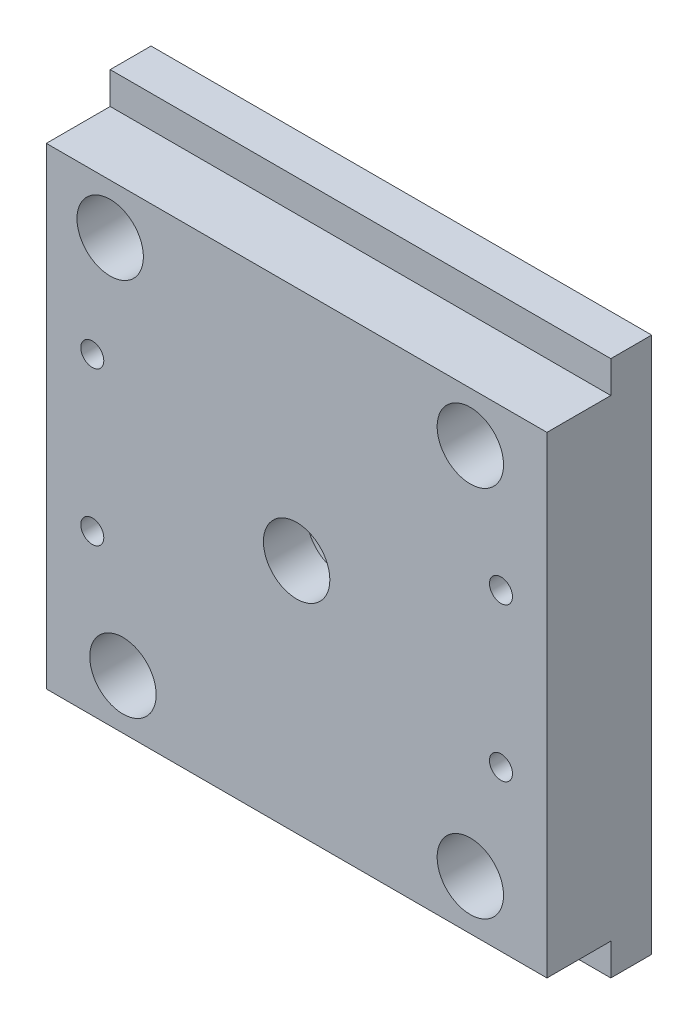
ISO-10303-21;
HEADER;
FILE_DESCRIPTION(('STEP AP214'),'2;1');
FILE_NAME('part.step','',(''),(''),'','','');
FILE_SCHEMA(('AUTOMOTIVE_DESIGN { 1 0 10303 214 1 1 1 1 }'));
ENDSEC;
DATA;
#1=APPLICATION_CONTEXT('core data for automotive mechanical design processes');
#2=APPLICATION_PROTOCOL_DEFINITION('international standard','automotive_design',2000,#1);
#3=PRODUCT_CONTEXT('',#1,'mechanical');
#4=PRODUCT('Part','Part','',(#3));
#5=PRODUCT_RELATED_PRODUCT_CATEGORY('part','',(#4));
#6=PRODUCT_DEFINITION_FORMATION('','',#4);
#7=PRODUCT_DEFINITION_CONTEXT('part definition',#1,'design');
#8=PRODUCT_DEFINITION('design','',#6,#7);
#9=PRODUCT_DEFINITION_SHAPE('','',#8);
#10=(LENGTH_UNIT() NAMED_UNIT(*) SI_UNIT(.MILLI.,.METRE.));
#11=(NAMED_UNIT(*) PLANE_ANGLE_UNIT() SI_UNIT($,.RADIAN.));
#12=(NAMED_UNIT(*) SI_UNIT($,.STERADIAN.) SOLID_ANGLE_UNIT());
#13=UNCERTAINTY_MEASURE_WITH_UNIT(LENGTH_MEASURE(1.E-05),#10,'distance_accuracy_value','');
#14=(GEOMETRIC_REPRESENTATION_CONTEXT(3) GLOBAL_UNCERTAINTY_ASSIGNED_CONTEXT((#13)) GLOBAL_UNIT_ASSIGNED_CONTEXT((#10,
#11,#12)) REPRESENTATION_CONTEXT('',''));
#15=CARTESIAN_POINT('',(0.,0.,0.));
#16=DIRECTION('',(0.,0.,1.));
#17=DIRECTION('',(1.,0.,0.));
#18=AXIS2_PLACEMENT_3D('',#15,#16,#17);
#19=CARTESIAN_POINT('',(25.,178.,41.000025));
#20=DIRECTION('',(0.,0.,-1.));
#21=DIRECTION('',(-1.,0.,0.));
#22=AXIS2_PLACEMENT_3D('',#19,#20,#21);
#23=CYLINDRICAL_SURFACE('',#22,13.);
#24=CARTESIAN_POINT('',(25.,178.,41.));
#25=DIRECTION('',(0.,0.,1.));
#26=DIRECTION('',(1.,0.,0.));
#27=AXIS2_PLACEMENT_3D('',#24,#25,#26);
#28=CIRCLE('',#27,13.);
#29=CARTESIAN_POINT('',(38.,178.,41.));
#30=VERTEX_POINT('',#29);
#31=EDGE_CURVE('E281',#30,#30,#28,.T.);
#32=ORIENTED_EDGE('',*,*,#31,.T.);
#33=EDGE_LOOP('',(#32));
#34=FACE_BOUND('',#33,.T.);
#35=CARTESIAN_POINT('',(25.,178.,6.3));
#36=DIRECTION('',(0.,0.,-1.));
#37=DIRECTION('',(-1.,0.,0.));
#38=AXIS2_PLACEMENT_3D('',#35,#36,#37);
#39=CIRCLE('',#38,13.);
#40=CARTESIAN_POINT('',(12.,178.,6.3));
#41=VERTEX_POINT('',#40);
#42=EDGE_CURVE('E210',#41,#41,#39,.F.);
#43=ORIENTED_EDGE('',*,*,#42,.F.);
#44=EDGE_LOOP('',(#43));
#45=FACE_BOUND('',#44,.T.);
#46=ADVANCED_FACE('F47',(#34,#45),#23,.F.);
#47=CARTESIAN_POINT('',(166.,178.,41.000025));
#48=DIRECTION('',(0.,0.,-1.));
#49=DIRECTION('',(-1.,0.,0.));
#50=AXIS2_PLACEMENT_3D('',#47,#48,#49);
#51=CYLINDRICAL_SURFACE('',#50,13.);
#52=CARTESIAN_POINT('',(166.,178.,41.));
#53=DIRECTION('',(0.,0.,1.));
#54=DIRECTION('',(1.,0.,0.));
#55=AXIS2_PLACEMENT_3D('',#52,#53,#54);
#56=CIRCLE('',#55,13.);
#57=CARTESIAN_POINT('',(179.,178.,41.));
#58=VERTEX_POINT('',#57);
#59=EDGE_CURVE('E312',#58,#58,#56,.T.);
#60=ORIENTED_EDGE('',*,*,#59,.T.);
#61=EDGE_LOOP('',(#60));
#62=FACE_BOUND('',#61,.T.);
#63=CARTESIAN_POINT('',(166.,178.,6.3));
#64=DIRECTION('',(0.,0.,-1.));
#65=DIRECTION('',(-1.,0.,0.));
#66=AXIS2_PLACEMENT_3D('',#63,#64,#65);
#67=CIRCLE('',#66,13.);
#68=CARTESIAN_POINT('',(153.,178.,6.3));
#69=VERTEX_POINT('',#68);
#70=EDGE_CURVE('E217',#69,#69,#67,.F.);
#71=ORIENTED_EDGE('',*,*,#70,.F.);
#72=EDGE_LOOP('',(#71));
#73=FACE_BOUND('',#72,.T.);
#74=ADVANCED_FACE('F508',(#62,#73),#51,.F.);
#75=CARTESIAN_POINT('',(166.,32.,41.000025));
#76=DIRECTION('',(0.,0.,-1.));
#77=DIRECTION('',(-1.,0.,0.));
#78=AXIS2_PLACEMENT_3D('',#75,#76,#77);
#79=CYLINDRICAL_SURFACE('',#78,13.);
#80=CARTESIAN_POINT('',(166.,32.,41.));
#81=DIRECTION('',(0.,0.,1.));
#82=DIRECTION('',(1.,0.,0.));
#83=AXIS2_PLACEMENT_3D('',#80,#81,#82);
#84=CIRCLE('',#83,13.);
#85=CARTESIAN_POINT('',(179.,32.,41.));
#86=VERTEX_POINT('',#85);
#87=EDGE_CURVE('E315',#86,#86,#84,.T.);
#88=ORIENTED_EDGE('',*,*,#87,.T.);
#89=EDGE_LOOP('',(#88));
#90=FACE_BOUND('',#89,.T.);
#91=CARTESIAN_POINT('',(166.,32.,6.3));
#92=DIRECTION('',(0.,0.,-1.));
#93=DIRECTION('',(-1.,0.,0.));
#94=AXIS2_PLACEMENT_3D('',#91,#92,#93);
#95=CIRCLE('',#94,13.);
#96=CARTESIAN_POINT('',(153.,32.,6.3));
#97=VERTEX_POINT('',#96);
#98=EDGE_CURVE('E224',#97,#97,#95,.F.);
#99=ORIENTED_EDGE('',*,*,#98,.F.);
#100=EDGE_LOOP('',(#99));
#101=FACE_BOUND('',#100,.T.);
#102=ADVANCED_FACE('F514',(#90,#101),#79,.F.);
#103=CARTESIAN_POINT('',(30.,32.,41.000025));
#104=DIRECTION('',(0.,0.,-1.));
#105=DIRECTION('',(-1.,0.,0.));
#106=AXIS2_PLACEMENT_3D('',#103,#104,#105);
#107=CYLINDRICAL_SURFACE('',#106,13.);
#108=CARTESIAN_POINT('',(30.,32.,41.));
#109=DIRECTION('',(0.,0.,1.));
#110=DIRECTION('',(1.,0.,0.));
#111=AXIS2_PLACEMENT_3D('',#108,#109,#110);
#112=CIRCLE('',#111,13.);
#113=CARTESIAN_POINT('',(43.,32.,41.));
#114=VERTEX_POINT('',#113);
#115=EDGE_CURVE('E318',#114,#114,#112,.T.);
#116=ORIENTED_EDGE('',*,*,#115,.T.);
#117=EDGE_LOOP('',(#116));
#118=FACE_BOUND('',#117,.T.);
#119=CARTESIAN_POINT('',(30.,32.,6.3));
#120=DIRECTION('',(0.,0.,-1.));
#121=DIRECTION('',(-1.,0.,0.));
#122=AXIS2_PLACEMENT_3D('',#119,#120,#121);
#123=CIRCLE('',#122,13.);
#124=CARTESIAN_POINT('',(17.,32.,6.3));
#125=VERTEX_POINT('',#124);
#126=EDGE_CURVE('E231',#125,#125,#123,.F.);
#127=ORIENTED_EDGE('',*,*,#126,.F.);
#128=EDGE_LOOP('',(#127));
#129=FACE_BOUND('',#128,.T.);
#130=ADVANCED_FACE('F877',(#118,#129),#107,.F.);
#131=CARTESIAN_POINT('',(178.,135.,41.000025));
#132=DIRECTION('',(0.,0.,-1.));
#133=DIRECTION('',(-1.,0.,0.));
#134=AXIS2_PLACEMENT_3D('',#131,#132,#133);
#135=CYLINDRICAL_SURFACE('',#134,4.49999999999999);
#136=CARTESIAN_POINT('',(178.,135.,41.));
#137=DIRECTION('',(0.,0.,1.));
#138=DIRECTION('',(1.,0.,0.));
#139=AXIS2_PLACEMENT_3D('',#136,#137,#138);
#140=CIRCLE('',#139,4.49999999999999);
#141=CARTESIAN_POINT('',(182.5,135.,41.));
#142=VERTEX_POINT('',#141);
#143=EDGE_CURVE('E330',#142,#142,#140,.T.);
#144=ORIENTED_EDGE('',*,*,#143,.T.);
#145=EDGE_LOOP('',(#144));
#146=FACE_BOUND('',#145,.T.);
#147=CARTESIAN_POINT('',(178.,135.,9.00000000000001));
#148=DIRECTION('',(0.,0.,-1.));
#149=DIRECTION('',(-1.,0.,0.));
#150=AXIS2_PLACEMENT_3D('',#147,#148,#149);
#151=CIRCLE('',#150,4.49999999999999);
#152=CARTESIAN_POINT('',(173.5,135.,9.00000000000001));
#153=VERTEX_POINT('',#152);
#154=EDGE_CURVE('E238',#153,#153,#151,.F.);
#155=ORIENTED_EDGE('',*,*,#154,.F.);
#156=EDGE_LOOP('',(#155));
#157=FACE_BOUND('',#156,.T.);
#158=ADVANCED_FACE('F884',(#146,#157),#135,.F.);
#159=CARTESIAN_POINT('',(178.,75.,41.000025));
#160=DIRECTION('',(0.,0.,-1.));
#161=DIRECTION('',(-1.,0.,0.));
#162=AXIS2_PLACEMENT_3D('',#159,#160,#161);
#163=CYLINDRICAL_SURFACE('',#162,4.49999999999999);
#164=CARTESIAN_POINT('',(178.,75.,41.));
#165=DIRECTION('',(0.,0.,1.));
#166=DIRECTION('',(1.,0.,0.));
#167=AXIS2_PLACEMENT_3D('',#164,#165,#166);
#168=CIRCLE('',#167,4.49999999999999);
#169=CARTESIAN_POINT('',(182.5,75.,41.));
#170=VERTEX_POINT('',#169);
#171=EDGE_CURVE('E327',#170,#170,#168,.T.);
#172=ORIENTED_EDGE('',*,*,#171,.T.);
#173=EDGE_LOOP('',(#172));
#174=FACE_BOUND('',#173,.T.);
#175=CARTESIAN_POINT('',(178.,75.,9.00000000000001));
#176=DIRECTION('',(0.,0.,-1.));
#177=DIRECTION('',(-1.,0.,0.));
#178=AXIS2_PLACEMENT_3D('',#175,#176,#177);
#179=CIRCLE('',#178,4.49999999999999);
#180=CARTESIAN_POINT('',(173.5,75.,9.00000000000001));
#181=VERTEX_POINT('',#180);
#182=EDGE_CURVE('E245',#181,#181,#179,.F.);
#183=ORIENTED_EDGE('',*,*,#182,.F.);
#184=EDGE_LOOP('',(#183));
#185=FACE_BOUND('',#184,.T.);
#186=ADVANCED_FACE('F893',(#174,#185),#163,.F.);
#187=CARTESIAN_POINT('',(18.,75.,41.000025));
#188=DIRECTION('',(0.,0.,-1.));
#189=DIRECTION('',(-1.,0.,0.));
#190=AXIS2_PLACEMENT_3D('',#187,#188,#189);
#191=CYLINDRICAL_SURFACE('',#190,4.50000000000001);
#192=CARTESIAN_POINT('',(18.,75.,41.));
#193=DIRECTION('',(0.,0.,1.));
#194=DIRECTION('',(1.,0.,0.));
#195=AXIS2_PLACEMENT_3D('',#192,#193,#194);
#196=CIRCLE('',#195,4.50000000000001);
#197=CARTESIAN_POINT('',(22.5,75.,41.));
#198=VERTEX_POINT('',#197);
#199=EDGE_CURVE('E321',#198,#198,#196,.T.);
#200=ORIENTED_EDGE('',*,*,#199,.T.);
#201=EDGE_LOOP('',(#200));
#202=FACE_BOUND('',#201,.T.);
#203=CARTESIAN_POINT('',(18.,75.,9.00000000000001));
#204=DIRECTION('',(0.,0.,-1.));
#205=DIRECTION('',(-1.,0.,0.));
#206=AXIS2_PLACEMENT_3D('',#203,#204,#205);
#207=CIRCLE('',#206,4.50000000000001);
#208=CARTESIAN_POINT('',(13.5,75.,9.00000000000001));
#209=VERTEX_POINT('',#208);
#210=EDGE_CURVE('E252',#209,#209,#207,.F.);
#211=ORIENTED_EDGE('',*,*,#210,.F.);
#212=EDGE_LOOP('',(#211));
#213=FACE_BOUND('',#212,.T.);
#214=ADVANCED_FACE('F903',(#202,#213),#191,.F.);
#215=CARTESIAN_POINT('',(18.,135.,41.000025));
#216=DIRECTION('',(0.,0.,-1.));
#217=DIRECTION('',(-1.,0.,0.));
#218=AXIS2_PLACEMENT_3D('',#215,#216,#217);
#219=CYLINDRICAL_SURFACE('',#218,4.50000000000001);
#220=CARTESIAN_POINT('',(18.,135.,41.));
#221=DIRECTION('',(0.,0.,1.));
#222=DIRECTION('',(1.,0.,0.));
#223=AXIS2_PLACEMENT_3D('',#220,#221,#222);
#224=CIRCLE('',#223,4.50000000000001);
#225=CARTESIAN_POINT('',(22.5,135.,41.));
#226=VERTEX_POINT('',#225);
#227=EDGE_CURVE('E324',#226,#226,#224,.T.);
#228=ORIENTED_EDGE('',*,*,#227,.T.);
#229=EDGE_LOOP('',(#228));
#230=FACE_BOUND('',#229,.T.);
#231=CARTESIAN_POINT('',(18.,135.,9.00000000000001));
#232=DIRECTION('',(0.,0.,-1.));
#233=DIRECTION('',(-1.,0.,0.));
#234=AXIS2_PLACEMENT_3D('',#231,#232,#233);
#235=CIRCLE('',#234,4.50000000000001);
#236=CARTESIAN_POINT('',(13.5,135.,9.00000000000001));
#237=VERTEX_POINT('',#236);
#238=EDGE_CURVE('E259',#237,#237,#235,.F.);
#239=ORIENTED_EDGE('',*,*,#238,.F.);
#240=EDGE_LOOP('',(#239));
#241=FACE_BOUND('',#240,.T.);
#242=ADVANCED_FACE('F913',(#230,#241),#219,.F.);
#243=CARTESIAN_POINT('',(98.,105.,24.));
#244=DIRECTION('',(0.,0.,-1.));
#245=DIRECTION('',(-1.,0.,0.));
#246=AXIS2_PLACEMENT_3D('',#243,#244,#245);
#247=CYLINDRICAL_SURFACE('',#246,26.);
#248=CARTESIAN_POINT('',(98.,105.,24.));
#249=DIRECTION('',(0.,0.,-1.));
#250=DIRECTION('',(-1.,0.,0.));
#251=AXIS2_PLACEMENT_3D('',#248,#249,#250);
#252=CIRCLE('',#251,26.);
#253=CARTESIAN_POINT('',(72.,105.,24.));
#254=VERTEX_POINT('',#253);
#255=EDGE_CURVE('E267',#254,#254,#252,.T.);
#256=ORIENTED_EDGE('',*,*,#255,.F.);
#257=EDGE_LOOP('',(#256));
#258=FACE_BOUND('',#257,.T.);
#259=CARTESIAN_POINT('',(95.0000000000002,130.82634314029,16.));
#260=CARTESIAN_POINT('',(94.9999915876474,130.826339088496,16.0840813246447));
#261=CARTESIAN_POINT('',(95.0035347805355,130.826753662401,16.1681584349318));
#262=CARTESIAN_POINT('',(95.0176592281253,130.828390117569,16.3357055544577));
#263=CARTESIAN_POINT('',(95.028239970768,130.829611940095,16.41917560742));
#264=CARTESIAN_POINT('',(95.0563598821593,130.832831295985,16.5848368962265));
#265=CARTESIAN_POINT('',(95.0738918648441,130.834828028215,16.6670293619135));
#266=CARTESIAN_POINT('',(95.1157677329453,130.839536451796,16.8296150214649));
#267=CARTESIAN_POINT('',(95.1401115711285,130.842248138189,16.9100082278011));
#268=CARTESIAN_POINT('',(95.22314963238,130.85134914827,17.147697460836));
#269=CARTESIAN_POINT('',(95.291865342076,130.858706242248,17.3015905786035));
#270=CARTESIAN_POINT('',(95.4539466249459,130.875165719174,17.5955645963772));
#271=CARTESIAN_POINT('',(95.5473104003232,130.884267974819,17.7356465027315));
#272=CARTESIAN_POINT('',(95.7565268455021,130.903240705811,17.9987953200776));
#273=CARTESIAN_POINT('',(95.8724711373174,130.91311420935,18.1217892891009));
#274=CARTESIAN_POINT('',(96.1233786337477,130.932491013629,18.3466311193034));
#275=CARTESIAN_POINT('',(96.2583454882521,130.941994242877,18.4484749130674));
#276=CARTESIAN_POINT('',(96.5439370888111,130.959591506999,18.6283945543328));
#277=CARTESIAN_POINT('',(96.6946080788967,130.967681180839,18.7063973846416));
#278=CARTESIAN_POINT('',(97.0069879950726,130.981499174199,18.8359251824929));
#279=CARTESIAN_POINT('',(97.1686899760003,130.987228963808,18.8874666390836));
#280=CARTESIAN_POINT('',(97.4427993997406,130.994259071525,18.9499349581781));
#281=CARTESIAN_POINT('',(97.5534637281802,130.996401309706,18.968694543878));
#282=CARTESIAN_POINT('',(97.7760691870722,130.999276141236,18.9937272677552));
#283=CARTESIAN_POINT('',(97.8880084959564,131.000010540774,19.0000164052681));
#284=CARTESIAN_POINT('',(98.0000000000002,131.,19.));
#285=B_SPLINE_CURVE_WITH_KNOTS('',3,(#259,#260,#261,#262,#263,#264,#265,#266,#267,#268,#269,
#270,#271,#272,#273,#274,#275,#276,#277,#278,#279,#280,#281,#282,#283,#284),.UNSPECIFIED.,.F.,
.F.,(4,2,2,2,2,2,2,2,2,2,2,2,4),(0.,0.25216081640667,0.504303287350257,0.756185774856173,
1.00806651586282,1.5115650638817,2.01502689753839,2.52057580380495,3.02622184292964,
3.5334013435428,4.04026441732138,4.37639073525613,4.71208553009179),.UNSPECIFIED.);
#286=CARTESIAN_POINT('',(95.0000000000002,130.82634314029,16.));
#287=VERTEX_POINT('',#286);
#288=CARTESIAN_POINT('',(98.0000000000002,131.,19.));
#289=VERTEX_POINT('',#288);
#290=EDGE_CURVE('E68',#287,#289,#285,.T.);
#291=ORIENTED_EDGE('',*,*,#290,.T.);
#292=CARTESIAN_POINT('',(98.0000000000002,131.,19.));
#293=CARTESIAN_POINT('',(98.0840832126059,131.000003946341,19.0000084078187));
#294=CARTESIAN_POINT('',(98.1681622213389,130.999592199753,18.9964650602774));
#295=CARTESIAN_POINT('',(98.3357132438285,130.997966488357,18.9823399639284));
#296=CARTESIAN_POINT('',(98.4191853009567,130.996752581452,18.9717587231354));
#297=CARTESIAN_POINT('',(98.584850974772,130.993553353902,18.9436373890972));
#298=CARTESIAN_POINT('',(98.6670458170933,130.991568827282,18.9261044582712));
#299=CARTESIAN_POINT('',(98.829636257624,130.98688769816,18.8842262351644));
#300=CARTESIAN_POINT('',(98.9100318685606,130.984191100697,18.859880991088));
#301=CARTESIAN_POINT('',(99.1477286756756,130.975137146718,18.7768378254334));
#302=CARTESIAN_POINT('',(99.301626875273,130.967813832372,18.7081176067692));
#303=CARTESIAN_POINT('',(99.5956092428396,130.951412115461,18.5460257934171));
#304=CARTESIAN_POINT('',(99.7356944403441,130.942333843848,18.4526560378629));
#305=CARTESIAN_POINT('',(99.9988393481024,130.923389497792,18.2434335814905));
#306=CARTESIAN_POINT('',(100.121827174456,130.913520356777,18.127490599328));
#307=CARTESIAN_POINT('',(100.346657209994,130.894130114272,17.8765882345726));
#308=CARTESIAN_POINT('',(100.448495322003,130.884609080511,17.7416251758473));
#309=CARTESIAN_POINT('',(100.62840903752,130.866961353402,17.456036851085));
#310=CARTESIAN_POINT('',(100.706410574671,130.858839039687,17.3053646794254));
#311=CARTESIAN_POINT('',(100.835935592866,130.844955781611,16.9929823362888));
#312=CARTESIAN_POINT('',(100.887475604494,130.839193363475,16.8312791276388));
#313=CARTESIAN_POINT('',(100.949939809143,130.832121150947,16.5571737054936));
#314=CARTESIAN_POINT('',(100.968697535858,130.829965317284,16.4465149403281));
#315=CARTESIAN_POINT('',(100.993727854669,130.827071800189,16.2239203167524));
#316=CARTESIAN_POINT('',(101.00001641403,130.826332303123,16.1119862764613));
#317=CARTESIAN_POINT('',(101.,130.82634314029,16.));
#318=B_SPLINE_CURVE_WITH_KNOTS('',3,(#292,#293,#294,#295,#296,#297,#298,#299,#300,#301,#302,
#303,#304,#305,#306,#307,#308,#309,#310,#311,#312,#313,#314,#315,#316,#317),.UNSPECIFIED.,.F.,
.F.,(4,2,2,2,2,2,2,2,2,2,2,2,4),(0.,0.252166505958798,0.504314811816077,0.756203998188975,
1.00809140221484,1.51160462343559,2.01508028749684,2.52061257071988,3.02624269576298,
3.53342833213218,4.04029674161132,4.37640645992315,4.71208549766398),.UNSPECIFIED.);
#319=CARTESIAN_POINT('',(101.,130.82634314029,16.));
#320=VERTEX_POINT('',#319);
#321=EDGE_CURVE('E177',#289,#320,#318,.T.);
#322=ORIENTED_EDGE('',*,*,#321,.T.);
#323=DIRECTION('',(0.,0.,-1.));
#324=VECTOR('',#323,1.);
#325=CARTESIAN_POINT('',(101.,130.82634314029,24.));
#326=LINE('',#325,#324);
#327=CARTESIAN_POINT('',(101.,130.82634314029,4.));
#328=VERTEX_POINT('',#327);
#329=EDGE_CURVE('E194',#320,#328,#326,.T.);
#330=ORIENTED_EDGE('',*,*,#329,.T.);
#331=CARTESIAN_POINT('',(98.,105.,4.));
#332=DIRECTION('',(0.,0.,-1.));
#333=DIRECTION('',(-1.,0.,0.));
#334=AXIS2_PLACEMENT_3D('',#331,#332,#333);
#335=CIRCLE('',#334,26.);
#336=CARTESIAN_POINT('',(95.0000000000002,130.82634314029,4.));
#337=VERTEX_POINT('',#336);
#338=EDGE_CURVE('E266',#337,#328,#335,.F.);
#339=ORIENTED_EDGE('',*,*,#338,.F.);
#340=DIRECTION('',(0.,0.,-1.));
#341=VECTOR('',#340,1.);
#342=CARTESIAN_POINT('',(95.0000000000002,130.82634314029,24.));
#343=LINE('',#342,#341);
#344=EDGE_CURVE('E192',#337,#287,#343,.F.);
#345=ORIENTED_EDGE('',*,*,#344,.T.);
#346=EDGE_LOOP('',(#291,#322,#330,#339,#345));
#347=FACE_BOUND('',#346,.T.);
#348=ADVANCED_FACE('F381',(#258,#347),#247,.F.);
#349=CARTESIAN_POINT('',(98.,105.,41.000025));
#350=DIRECTION('',(0.,0.,-1.));
#351=DIRECTION('',(-1.,0.,0.));
#352=AXIS2_PLACEMENT_3D('',#349,#350,#351);
#353=CYLINDRICAL_SURFACE('',#352,13.);
#354=CARTESIAN_POINT('',(98.,105.,41.));
#355=DIRECTION('',(0.,0.,1.));
#356=DIRECTION('',(1.,0.,0.));
#357=AXIS2_PLACEMENT_3D('',#354,#355,#356);
#358=CIRCLE('',#357,13.);
#359=CARTESIAN_POINT('',(111.,105.,41.));
#360=VERTEX_POINT('',#359);
#361=EDGE_CURVE('E333',#360,#360,#358,.T.);
#362=ORIENTED_EDGE('',*,*,#361,.T.);
#363=EDGE_LOOP('',(#362));
#364=FACE_BOUND('',#363,.T.);
#365=CARTESIAN_POINT('',(98.,105.,24.));
#366=DIRECTION('',(0.,0.,-1.));
#367=DIRECTION('',(-1.,0.,0.));
#368=AXIS2_PLACEMENT_3D('',#365,#366,#367);
#369=CIRCLE('',#368,13.);
#370=CARTESIAN_POINT('',(85.,105.,24.));
#371=VERTEX_POINT('',#370);
#372=EDGE_CURVE('E270',#371,#371,#369,.F.);
#373=ORIENTED_EDGE('',*,*,#372,.F.);
#374=EDGE_LOOP('',(#373));
#375=FACE_BOUND('',#374,.T.);
#376=ADVANCED_FACE('F536',(#364,#375),#353,.F.);
#377=CARTESIAN_POINT('',(0.,0.,16.));
#378=DIRECTION('',(0.,0.,-1.));
#379=DIRECTION('',(-1.,0.,0.));
#380=AXIS2_PLACEMENT_3D('',#377,#378,#379);
#381=PLANE('',#380);
#382=DIRECTION('',(-1.,0.,0.));
#383=VECTOR('',#382,1.);
#384=CARTESIAN_POINT('',(0.,197.5,16.));
#385=LINE('',#384,#383);
#386=CARTESIAN_POINT('',(196.,197.5,16.));
#387=VERTEX_POINT('',#386);
#388=CARTESIAN_POINT('',(0.,197.5,16.));
#389=VERTEX_POINT('',#388);
#390=EDGE_CURVE('E280',#387,#389,#385,.T.);
#391=ORIENTED_EDGE('',*,*,#390,.F.);
#392=DIRECTION('',(0.,1.,0.));
#393=VECTOR('',#392,1.);
#394=CARTESIAN_POINT('',(196.,0.,16.));
#395=LINE('',#394,#393);
#396=CARTESIAN_POINT('',(196.,210.,16.));
#397=VERTEX_POINT('',#396);
#398=EDGE_CURVE('E282',#387,#397,#395,.T.);
#399=ORIENTED_EDGE('',*,*,#398,.T.);
#400=DIRECTION('',(-1.,0.,0.));
#401=VECTOR('',#400,1.);
#402=CARTESIAN_POINT('',(0.,210.,16.));
#403=LINE('',#402,#401);
#404=CARTESIAN_POINT('',(0.,210.,16.));
#405=VERTEX_POINT('',#404);
#406=EDGE_CURVE('E590',#397,#405,#403,.T.);
#407=ORIENTED_EDGE('',*,*,#406,.T.);
#408=DIRECTION('',(0.,-1.,0.));
#409=VECTOR('',#408,1.);
#410=CARTESIAN_POINT('',(0.,0.,16.));
#411=LINE('',#410,#409);
#412=EDGE_CURVE('E583',#405,#389,#411,.T.);
#413=ORIENTED_EDGE('',*,*,#412,.T.);
#414=EDGE_LOOP('',(#391,#399,#407,#413));
#415=FACE_BOUND('',#414,.T.);
#416=ADVANCED_FACE('F532',(#415),#381,.F.);
#417=DIRECTION('',(1.,0.,0.));
#418=VECTOR('',#417,1.);
#419=CARTESIAN_POINT('',(0.,12.5,16.));
#420=LINE('',#419,#418);
#421=CARTESIAN_POINT('',(0.,12.5,16.));
#422=VERTEX_POINT('',#421);
#423=CARTESIAN_POINT('',(196.,12.5,16.));
#424=VERTEX_POINT('',#423);
#425=EDGE_CURVE('E276',#422,#424,#420,.T.);
#426=ORIENTED_EDGE('',*,*,#425,.F.);
#427=CARTESIAN_POINT('',(0.,0.,16.));
#428=VERTEX_POINT('',#427);
#429=EDGE_CURVE('E573',#422,#428,#411,.T.);
#430=ORIENTED_EDGE('',*,*,#429,.T.);
#431=DIRECTION('',(1.,0.,0.));
#432=VECTOR('',#431,1.);
#433=CARTESIAN_POINT('',(0.,0.,16.));
#434=LINE('',#433,#432);
#435=CARTESIAN_POINT('',(196.,0.,16.));
#436=VERTEX_POINT('',#435);
#437=EDGE_CURVE('E579',#428,#436,#434,.T.);
#438=ORIENTED_EDGE('',*,*,#437,.T.);
#439=EDGE_CURVE('E567',#436,#424,#395,.T.);
#440=ORIENTED_EDGE('',*,*,#439,.T.);
#441=EDGE_LOOP('',(#426,#430,#438,#440));
#442=FACE_BOUND('',#441,.T.);
#443=ADVANCED_FACE('F535',(#442),#381,.F.);
#444=CARTESIAN_POINT('',(0.,0.,16.));
#445=DIRECTION('',(1.,0.,0.));
#446=DIRECTION('',(0.,0.,-1.));
#447=AXIS2_PLACEMENT_3D('',#444,#445,#446);
#448=PLANE('',#447);
#449=DIRECTION('',(0.,-1.,0.));
#450=VECTOR('',#449,1.);
#451=CARTESIAN_POINT('',(0.,0.,0.));
#452=LINE('',#451,#450);
#453=CARTESIAN_POINT('',(0.,210.,0.));
#454=VERTEX_POINT('',#453);
#455=CARTESIAN_POINT('',(0.,0.,0.));
#456=VERTEX_POINT('',#455);
#457=EDGE_CURVE('E294',#454,#456,#452,.T.);
#458=ORIENTED_EDGE('',*,*,#457,.T.);
#459=DIRECTION('',(0.,0.,-1.));
#460=VECTOR('',#459,1.);
#461=CARTESIAN_POINT('',(0.,0.,16.));
#462=LINE('',#461,#460);
#463=EDGE_CURVE('E364',#428,#456,#462,.T.);
#464=ORIENTED_EDGE('',*,*,#463,.F.);
#465=ORIENTED_EDGE('',*,*,#429,.F.);
#466=DIRECTION('',(0.,0.,-1.));
#467=VECTOR('',#466,1.);
#468=CARTESIAN_POINT('',(0.,12.5,41.));
#469=LINE('',#468,#467);
#470=CARTESIAN_POINT('',(0.,12.5,41.));
#471=VERTEX_POINT('',#470);
#472=EDGE_CURVE('E288',#471,#422,#469,.T.);
#473=ORIENTED_EDGE('',*,*,#472,.F.);
#474=DIRECTION('',(0.,-1.,0.));
#475=VECTOR('',#474,1.);
#476=CARTESIAN_POINT('',(0.,197.5,41.));
#477=LINE('',#476,#475);
#478=CARTESIAN_POINT('',(0.,197.5,41.));
#479=VERTEX_POINT('',#478);
#480=EDGE_CURVE('E299',#479,#471,#477,.T.);
#481=ORIENTED_EDGE('',*,*,#480,.F.);
#482=DIRECTION('',(0.,0.,-1.));
#483=VECTOR('',#482,1.);
#484=CARTESIAN_POINT('',(0.,197.5,41.));
#485=LINE('',#484,#483);
#486=EDGE_CURVE('E300',#479,#389,#485,.T.);
#487=ORIENTED_EDGE('',*,*,#486,.T.);
#488=ORIENTED_EDGE('',*,*,#412,.F.);
#489=DIRECTION('',(0.,0.,-1.));
#490=VECTOR('',#489,1.);
#491=CARTESIAN_POINT('',(0.,210.,16.));
#492=LINE('',#491,#490);
#493=EDGE_CURVE('E587',#405,#454,#492,.T.);
#494=ORIENTED_EDGE('',*,*,#493,.T.);
#495=EDGE_LOOP('',(#458,#464,#465,#473,#481,#487,#488,#494));
#496=FACE_BOUND('',#495,.T.);
#497=ADVANCED_FACE('F49',(#496),#448,.F.);
#498=CARTESIAN_POINT('',(0.,0.,16.));
#499=DIRECTION('',(0.,1.,0.));
#500=DIRECTION('',(0.,0.,1.));
#501=AXIS2_PLACEMENT_3D('',#498,#499,#500);
#502=PLANE('',#501);
#503=DIRECTION('',(1.,0.,0.));
#504=VECTOR('',#503,1.);
#505=CARTESIAN_POINT('',(0.,0.,0.));
#506=LINE('',#505,#504);
#507=CARTESIAN_POINT('',(196.,0.,0.));
#508=VERTEX_POINT('',#507);
#509=EDGE_CURVE('E553',#456,#508,#506,.T.);
#510=ORIENTED_EDGE('',*,*,#509,.T.);
#511=DIRECTION('',(0.,0.,-1.));
#512=VECTOR('',#511,1.);
#513=CARTESIAN_POINT('',(196.,0.,16.));
#514=LINE('',#513,#512);
#515=EDGE_CURVE('E556',#436,#508,#514,.T.);
#516=ORIENTED_EDGE('',*,*,#515,.F.);
#517=ORIENTED_EDGE('',*,*,#437,.F.);
#518=ORIENTED_EDGE('',*,*,#463,.T.);
#519=EDGE_LOOP('',(#510,#516,#517,#518));
#520=FACE_BOUND('',#519,.T.);
#521=ADVANCED_FACE('F543',(#520),#502,.F.);
#522=CARTESIAN_POINT('',(196.,0.,16.));
#523=DIRECTION('',(-1.,0.,0.));
#524=DIRECTION('',(0.,0.,1.));
#525=AXIS2_PLACEMENT_3D('',#522,#523,#524);
#526=PLANE('',#525);
#527=DIRECTION('',(0.,1.,0.));
#528=VECTOR('',#527,1.);
#529=CARTESIAN_POINT('',(196.,0.,0.));
#530=LINE('',#529,#528);
#531=CARTESIAN_POINT('',(196.,210.,0.));
#532=VERTEX_POINT('',#531);
#533=EDGE_CURVE('E563',#508,#532,#530,.T.);
#534=ORIENTED_EDGE('',*,*,#533,.T.);
#535=DIRECTION('',(0.,0.,-1.));
#536=VECTOR('',#535,1.);
#537=CARTESIAN_POINT('',(196.,210.,16.));
#538=LINE('',#537,#536);
#539=EDGE_CURVE('E568',#397,#532,#538,.T.);
#540=ORIENTED_EDGE('',*,*,#539,.F.);
#541=ORIENTED_EDGE('',*,*,#398,.F.);
#542=DIRECTION('',(0.,0.,-1.));
#543=VECTOR('',#542,1.);
#544=CARTESIAN_POINT('',(196.,197.5,41.));
#545=LINE('',#544,#543);
#546=CARTESIAN_POINT('',(196.,197.5,41.));
#547=VERTEX_POINT('',#546);
#548=EDGE_CURVE('E289',#547,#387,#545,.T.);
#549=ORIENTED_EDGE('',*,*,#548,.F.);
#550=DIRECTION('',(0.,1.,0.));
#551=VECTOR('',#550,1.);
#552=CARTESIAN_POINT('',(196.,197.5,41.));
#553=LINE('',#552,#551);
#554=CARTESIAN_POINT('',(196.,12.5,41.));
#555=VERTEX_POINT('',#554);
#556=EDGE_CURVE('E601',#555,#547,#553,.T.);
#557=ORIENTED_EDGE('',*,*,#556,.F.);
#558=DIRECTION('',(0.,0.,-1.));
#559=VECTOR('',#558,1.);
#560=CARTESIAN_POINT('',(196.,12.5,41.));
#561=LINE('',#560,#559);
#562=EDGE_CURVE('E285',#555,#424,#561,.T.);
#563=ORIENTED_EDGE('',*,*,#562,.T.);
#564=ORIENTED_EDGE('',*,*,#439,.F.);
#565=ORIENTED_EDGE('',*,*,#515,.T.);
#566=EDGE_LOOP('',(#534,#540,#541,#549,#557,#563,#564,#565));
#567=FACE_BOUND('',#566,.T.);
#568=ADVANCED_FACE('F540',(#567),#526,.F.);
#569=CARTESIAN_POINT('',(0.,210.,16.));
#570=DIRECTION('',(0.,-1.,0.));
#571=DIRECTION('',(1.,0.,0.));
#572=AXIS2_PLACEMENT_3D('',#569,#570,#571);
#573=PLANE('',#572);
#574=DIRECTION('',(-1.,0.,0.));
#575=VECTOR('',#574,1.);
#576=CARTESIAN_POINT('',(0.,210.,0.));
#577=LINE('',#576,#575);
#578=EDGE_CURVE('E571',#532,#454,#577,.T.);
#579=ORIENTED_EDGE('',*,*,#578,.T.);
#580=ORIENTED_EDGE('',*,*,#493,.F.);
#581=ORIENTED_EDGE('',*,*,#406,.F.);
#582=ORIENTED_EDGE('',*,*,#539,.T.);
#583=EDGE_LOOP('',(#579,#580,#581,#582));
#584=FACE_BOUND('',#583,.T.);
#585=ADVANCED_FACE('F530',(#584),#573,.F.);
#586=CARTESIAN_POINT('',(0.,0.,0.));
#587=DIRECTION('',(0.,0.,-1.));
#588=DIRECTION('',(-1.,0.,0.));
#589=AXIS2_PLACEMENT_3D('',#586,#587,#588);
#590=PLANE('',#589);
#591=CARTESIAN_POINT('',(25.,178.,0.));
#592=DIRECTION('',(0.,0.,-1.));
#593=DIRECTION('',(-1.,0.,0.));
#594=AXIS2_PLACEMENT_3D('',#591,#592,#593);
#595=CIRCLE('',#594,16.5);
#596=CARTESIAN_POINT('',(8.49999999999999,178.,0.));
#597=VERTEX_POINT('',#596);
#598=EDGE_CURVE('E204',#597,#597,#595,.T.);
#599=ORIENTED_EDGE('',*,*,#598,.F.);
#600=EDGE_LOOP('',(#599));
#601=FACE_BOUND('',#600,.T.);
#602=CARTESIAN_POINT('',(166.,178.,0.));
#603=DIRECTION('',(0.,0.,-1.));
#604=DIRECTION('',(-1.,0.,0.));
#605=AXIS2_PLACEMENT_3D('',#602,#603,#604);
#606=CIRCLE('',#605,16.5);
#607=CARTESIAN_POINT('',(149.5,178.,0.));
#608=VERTEX_POINT('',#607);
#609=EDGE_CURVE('E211',#608,#608,#606,.T.);
#610=ORIENTED_EDGE('',*,*,#609,.F.);
#611=EDGE_LOOP('',(#610));
#612=FACE_BOUND('',#611,.T.);
#613=CARTESIAN_POINT('',(166.,32.,0.));
#614=DIRECTION('',(0.,0.,-1.));
#615=DIRECTION('',(-1.,0.,0.));
#616=AXIS2_PLACEMENT_3D('',#613,#614,#615);
#617=CIRCLE('',#616,16.5);
#618=CARTESIAN_POINT('',(149.5,32.,0.));
#619=VERTEX_POINT('',#618);
#620=EDGE_CURVE('E218',#619,#619,#617,.T.);
#621=ORIENTED_EDGE('',*,*,#620,.F.);
#622=EDGE_LOOP('',(#621));
#623=FACE_BOUND('',#622,.T.);
#624=CARTESIAN_POINT('',(30.,32.,0.));
#625=DIRECTION('',(0.,0.,-1.));
#626=DIRECTION('',(-1.,0.,0.));
#627=AXIS2_PLACEMENT_3D('',#624,#625,#626);
#628=CIRCLE('',#627,16.5);
#629=CARTESIAN_POINT('',(13.5,32.,0.));
#630=VERTEX_POINT('',#629);
#631=EDGE_CURVE('E225',#630,#630,#628,.T.);
#632=ORIENTED_EDGE('',*,*,#631,.F.);
#633=EDGE_LOOP('',(#632));
#634=FACE_BOUND('',#633,.T.);
#635=CARTESIAN_POINT('',(178.,135.,0.));
#636=DIRECTION('',(0.,0.,-1.));
#637=DIRECTION('',(-1.,0.,0.));
#638=AXIS2_PLACEMENT_3D('',#635,#636,#637);
#639=CIRCLE('',#638,8.00000000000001);
#640=CARTESIAN_POINT('',(170.,135.,0.));
#641=VERTEX_POINT('',#640);
#642=EDGE_CURVE('E232',#641,#641,#639,.T.);
#643=ORIENTED_EDGE('',*,*,#642,.F.);
#644=EDGE_LOOP('',(#643));
#645=FACE_BOUND('',#644,.T.);
#646=CARTESIAN_POINT('',(178.,75.,0.));
#647=DIRECTION('',(0.,0.,-1.));
#648=DIRECTION('',(-1.,0.,0.));
#649=AXIS2_PLACEMENT_3D('',#646,#647,#648);
#650=CIRCLE('',#649,8.00000000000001);
#651=CARTESIAN_POINT('',(170.,75.,0.));
#652=VERTEX_POINT('',#651);
#653=EDGE_CURVE('E239',#652,#652,#650,.T.);
#654=ORIENTED_EDGE('',*,*,#653,.F.);
#655=EDGE_LOOP('',(#654));
#656=FACE_BOUND('',#655,.T.);
#657=CARTESIAN_POINT('',(18.,75.,0.));
#658=DIRECTION('',(0.,0.,-1.));
#659=DIRECTION('',(-1.,0.,0.));
#660=AXIS2_PLACEMENT_3D('',#657,#658,#659);
#661=CIRCLE('',#660,8.);
#662=CARTESIAN_POINT('',(9.99999999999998,75.,0.));
#663=VERTEX_POINT('',#662);
#664=EDGE_CURVE('E246',#663,#663,#661,.T.);
#665=ORIENTED_EDGE('',*,*,#664,.F.);
#666=EDGE_LOOP('',(#665));
#667=FACE_BOUND('',#666,.T.);
#668=CARTESIAN_POINT('',(18.,135.,0.));
#669=DIRECTION('',(0.,0.,-1.));
#670=DIRECTION('',(-1.,0.,0.));
#671=AXIS2_PLACEMENT_3D('',#668,#669,#670);
#672=CIRCLE('',#671,8.);
#673=CARTESIAN_POINT('',(10.,135.,0.));
#674=VERTEX_POINT('',#673);
#675=EDGE_CURVE('E253',#674,#674,#672,.T.);
#676=ORIENTED_EDGE('',*,*,#675,.F.);
#677=EDGE_LOOP('',(#676));
#678=FACE_BOUND('',#677,.T.);
#679=CARTESIAN_POINT('',(98.,105.,0.));
#680=DIRECTION('',(0.,0.,-1.));
#681=DIRECTION('',(-1.,0.,0.));
#682=AXIS2_PLACEMENT_3D('',#679,#680,#681);
#683=CIRCLE('',#682,45.);
#684=CARTESIAN_POINT('',(53.,105.,0.));
#685=VERTEX_POINT('',#684);
#686=EDGE_CURVE('E260',#685,#685,#683,.T.);
#687=ORIENTED_EDGE('',*,*,#686,.F.);
#688=EDGE_LOOP('',(#687));
#689=FACE_BOUND('',#688,.T.);
#690=ORIENTED_EDGE('',*,*,#457,.F.);
#691=ORIENTED_EDGE('',*,*,#578,.F.);
#692=ORIENTED_EDGE('',*,*,#533,.F.);
#693=ORIENTED_EDGE('',*,*,#509,.F.);
#694=EDGE_LOOP('',(#690,#691,#692,#693));
#695=FACE_BOUND('',#694,.T.);
#696=ADVANCED_FACE('F526',(#601,#612,#623,#634,#645,#656,#667,#678,#689,#695),#590,.T.);
#697=CARTESIAN_POINT('',(0.,12.5,41.));
#698=DIRECTION('',(0.,1.,0.));
#699=DIRECTION('',(0.,0.,1.));
#700=AXIS2_PLACEMENT_3D('',#697,#698,#699);
#701=PLANE('',#700);
#702=ORIENTED_EDGE('',*,*,#425,.T.);
#703=ORIENTED_EDGE('',*,*,#562,.F.);
#704=DIRECTION('',(1.,0.,0.));
#705=VECTOR('',#704,1.);
#706=CARTESIAN_POINT('',(0.,12.5,41.));
#707=LINE('',#706,#705);
#708=EDGE_CURVE('E603',#471,#555,#707,.T.);
#709=ORIENTED_EDGE('',*,*,#708,.F.);
#710=ORIENTED_EDGE('',*,*,#472,.T.);
#711=EDGE_LOOP('',(#702,#703,#709,#710));
#712=FACE_BOUND('',#711,.T.);
#713=ADVANCED_FACE('F522',(#712),#701,.F.);
#714=CARTESIAN_POINT('',(0.,197.5,41.));
#715=DIRECTION('',(0.,-1.,0.));
#716=DIRECTION('',(0.,0.,-1.));
#717=AXIS2_PLACEMENT_3D('',#714,#715,#716);
#718=PLANE('',#717);
#719=ORIENTED_EDGE('',*,*,#390,.T.);
#720=ORIENTED_EDGE('',*,*,#486,.F.);
#721=DIRECTION('',(-1.,0.,0.));
#722=VECTOR('',#721,1.);
#723=CARTESIAN_POINT('',(0.,197.5,41.));
#724=LINE('',#723,#722);
#725=EDGE_CURVE('E303',#547,#479,#724,.T.);
#726=ORIENTED_EDGE('',*,*,#725,.F.);
#727=ORIENTED_EDGE('',*,*,#548,.T.);
#728=EDGE_LOOP('',(#719,#720,#726,#727));
#729=FACE_BOUND('',#728,.T.);
#730=ADVANCED_FACE('F503',(#729),#718,.F.);
#731=CARTESIAN_POINT('',(0.,12.5,41.));
#732=DIRECTION('',(0.,0.,1.));
#733=DIRECTION('',(1.,0.,0.));
#734=AXIS2_PLACEMENT_3D('',#731,#732,#733);
#735=PLANE('',#734);
#736=ORIENTED_EDGE('',*,*,#361,.F.);
#737=EDGE_LOOP('',(#736));
#738=FACE_BOUND('',#737,.T.);
#739=ORIENTED_EDGE('',*,*,#143,.F.);
#740=EDGE_LOOP('',(#739));
#741=FACE_BOUND('',#740,.T.);
#742=ORIENTED_EDGE('',*,*,#171,.F.);
#743=EDGE_LOOP('',(#742));
#744=FACE_BOUND('',#743,.T.);
#745=ORIENTED_EDGE('',*,*,#227,.F.);
#746=EDGE_LOOP('',(#745));
#747=FACE_BOUND('',#746,.T.);
#748=ORIENTED_EDGE('',*,*,#199,.F.);
#749=EDGE_LOOP('',(#748));
#750=FACE_BOUND('',#749,.T.);
#751=ORIENTED_EDGE('',*,*,#115,.F.);
#752=EDGE_LOOP('',(#751));
#753=FACE_BOUND('',#752,.T.);
#754=ORIENTED_EDGE('',*,*,#87,.F.);
#755=EDGE_LOOP('',(#754));
#756=FACE_BOUND('',#755,.T.);
#757=ORIENTED_EDGE('',*,*,#59,.F.);
#758=EDGE_LOOP('',(#757));
#759=FACE_BOUND('',#758,.T.);
#760=ORIENTED_EDGE('',*,*,#31,.F.);
#761=EDGE_LOOP('',(#760));
#762=FACE_BOUND('',#761,.T.);
#763=ORIENTED_EDGE('',*,*,#480,.T.);
#764=ORIENTED_EDGE('',*,*,#708,.T.);
#765=ORIENTED_EDGE('',*,*,#556,.T.);
#766=ORIENTED_EDGE('',*,*,#725,.T.);
#767=EDGE_LOOP('',(#763,#764,#765,#766));
#768=FACE_BOUND('',#767,.T.);
#769=ADVANCED_FACE('F498',(#738,#741,#744,#747,#750,#753,#756,#759,#762,#768),#735,.T.);
#770=CARTESIAN_POINT('',(98.,105.,24.));
#771=DIRECTION('',(0.,0.,-1.));
#772=DIRECTION('',(-1.,0.,0.));
#773=AXIS2_PLACEMENT_3D('',#770,#771,#772);
#774=PLANE('',#773);
#775=ORIENTED_EDGE('',*,*,#255,.T.);
#776=EDGE_LOOP('',(#775));
#777=FACE_BOUND('',#776,.T.);
#778=ORIENTED_EDGE('',*,*,#372,.T.);
#779=EDGE_LOOP('',(#778));
#780=FACE_BOUND('',#779,.T.);
#781=ADVANCED_FACE('F494',(#777,#780),#774,.T.);
#782=CARTESIAN_POINT('',(98.,105.,4.));
#783=DIRECTION('',(0.,0.,-1.));
#784=DIRECTION('',(-1.,0.,0.));
#785=AXIS2_PLACEMENT_3D('',#782,#783,#784);
#786=PLANE('',#785);
#787=DIRECTION('',(0.,-1.,0.));
#788=VECTOR('',#787,1.);
#789=CARTESIAN_POINT('',(101.,126.025715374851,4.));
#790=LINE('',#789,#788);
#791=CARTESIAN_POINT('',(101.,142.,4.));
#792=VERTEX_POINT('',#791);
#793=EDGE_CURVE('E189',#792,#328,#790,.T.);
#794=ORIENTED_EDGE('',*,*,#793,.F.);
#795=CARTESIAN_POINT('',(98.0000000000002,142.,4.));
#796=DIRECTION('',(0.,0.,-1.));
#797=DIRECTION('',(-1.,0.,0.));
#798=AXIS2_PLACEMENT_3D('',#795,#796,#797);
#799=CIRCLE('',#798,3.);
#800=CARTESIAN_POINT('',(98.0000000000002,145.,4.));
#801=VERTEX_POINT('',#800);
#802=EDGE_CURVE('E13',#792,#801,#799,.F.);
#803=ORIENTED_EDGE('',*,*,#802,.T.);
#804=CARTESIAN_POINT('',(98.0000000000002,142.,4.));
#805=DIRECTION('',(0.,0.,-1.));
#806=DIRECTION('',(-1.,0.,0.));
#807=AXIS2_PLACEMENT_3D('',#804,#805,#806);
#808=CIRCLE('',#807,3.);
#809=CARTESIAN_POINT('',(95.0000000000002,142.,4.));
#810=VERTEX_POINT('',#809);
#811=EDGE_CURVE('E55',#801,#810,#808,.F.);
#812=ORIENTED_EDGE('',*,*,#811,.T.);
#813=DIRECTION('',(0.,1.,0.));
#814=VECTOR('',#813,1.);
#815=CARTESIAN_POINT('',(95.0000000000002,105.,4.));
#816=LINE('',#815,#814);
#817=EDGE_CURVE('E360',#337,#810,#816,.T.);
#818=ORIENTED_EDGE('',*,*,#817,.F.);
#819=ORIENTED_EDGE('',*,*,#338,.T.);
#820=EDGE_LOOP('',(#794,#803,#812,#818,#819));
#821=FACE_BOUND('',#820,.T.);
#822=CARTESIAN_POINT('',(63.,105.,4.));
#823=DIRECTION('',(0.,0.,-1.));
#824=DIRECTION('',(-1.,0.,0.));
#825=AXIS2_PLACEMENT_3D('',#822,#823,#824);
#826=CIRCLE('',#825,2.49999999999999);
#827=CARTESIAN_POINT('',(60.5,105.,4.));
#828=VERTEX_POINT('',#827);
#829=EDGE_CURVE('E199',#828,#828,#826,.T.);
#830=ORIENTED_EDGE('',*,*,#829,.F.);
#831=EDGE_LOOP('',(#830));
#832=FACE_BOUND('',#831,.T.);
#833=CARTESIAN_POINT('',(133.,105.,4.));
#834=DIRECTION('',(0.,0.,-1.));
#835=DIRECTION('',(-1.,0.,0.));
#836=AXIS2_PLACEMENT_3D('',#833,#834,#835);
#837=CIRCLE('',#836,2.49999999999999);
#838=CARTESIAN_POINT('',(130.5,105.,4.));
#839=VERTEX_POINT('',#838);
#840=EDGE_CURVE('E203',#839,#839,#837,.T.);
#841=ORIENTED_EDGE('',*,*,#840,.F.);
#842=EDGE_LOOP('',(#841));
#843=FACE_BOUND('',#842,.T.);
#844=CARTESIAN_POINT('',(98.,105.,4.));
#845=DIRECTION('',(0.,0.,-1.));
#846=DIRECTION('',(-1.,0.,0.));
#847=AXIS2_PLACEMENT_3D('',#844,#845,#846);
#848=CIRCLE('',#847,45.);
#849=CARTESIAN_POINT('',(53.,105.,4.));
#850=VERTEX_POINT('',#849);
#851=EDGE_CURVE('E263',#850,#850,#848,.T.);
#852=ORIENTED_EDGE('',*,*,#851,.T.);
#853=EDGE_LOOP('',(#852));
#854=FACE_BOUND('',#853,.T.);
#855=ADVANCED_FACE('F491',(#821,#832,#843,#854),#786,.T.);
#856=CARTESIAN_POINT('',(98.,105.,4.));
#857=DIRECTION('',(0.,0.,-1.));
#858=DIRECTION('',(-1.,0.,0.));
#859=AXIS2_PLACEMENT_3D('',#856,#857,#858);
#860=CYLINDRICAL_SURFACE('',#859,45.);
#861=ORIENTED_EDGE('',*,*,#851,.F.);
#862=EDGE_LOOP('',(#861));
#863=FACE_BOUND('',#862,.T.);
#864=ORIENTED_EDGE('',*,*,#686,.T.);
#865=EDGE_LOOP('',(#864));
#866=FACE_BOUND('',#865,.T.);
#867=ADVANCED_FACE('F486',(#863,#866),#860,.F.);
#868=CARTESIAN_POINT('',(18.,135.,9.00000000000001));
#869=DIRECTION('',(0.,0.,-1.));
#870=DIRECTION('',(-1.,0.,0.));
#871=AXIS2_PLACEMENT_3D('',#868,#869,#870);
#872=PLANE('',#871);
#873=CARTESIAN_POINT('',(18.,135.,9.00000000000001));
#874=DIRECTION('',(0.,0.,-1.));
#875=DIRECTION('',(-1.,0.,0.));
#876=AXIS2_PLACEMENT_3D('',#873,#874,#875);
#877=CIRCLE('',#876,8.);
#878=CARTESIAN_POINT('',(10.,135.,9.00000000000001));
#879=VERTEX_POINT('',#878);
#880=EDGE_CURVE('E256',#879,#879,#877,.T.);
#881=ORIENTED_EDGE('',*,*,#880,.T.);
#882=EDGE_LOOP('',(#881));
#883=FACE_BOUND('',#882,.T.);
#884=ORIENTED_EDGE('',*,*,#238,.T.);
#885=EDGE_LOOP('',(#884));
#886=FACE_BOUND('',#885,.T.);
#887=ADVANCED_FACE('F483',(#883,#886),#872,.T.);
#888=CARTESIAN_POINT('',(18.,135.,9.00000000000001));
#889=DIRECTION('',(0.,0.,-1.));
#890=DIRECTION('',(-1.,0.,0.));
#891=AXIS2_PLACEMENT_3D('',#888,#889,#890);
#892=CYLINDRICAL_SURFACE('',#891,8.);
#893=ORIENTED_EDGE('',*,*,#880,.F.);
#894=EDGE_LOOP('',(#893));
#895=FACE_BOUND('',#894,.T.);
#896=ORIENTED_EDGE('',*,*,#675,.T.);
#897=EDGE_LOOP('',(#896));
#898=FACE_BOUND('',#897,.T.);
#899=ADVANCED_FACE('F478',(#895,#898),#892,.F.);
#900=CARTESIAN_POINT('',(18.,75.,9.00000000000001));
#901=DIRECTION('',(0.,0.,-1.));
#902=DIRECTION('',(-1.,0.,0.));
#903=AXIS2_PLACEMENT_3D('',#900,#901,#902);
#904=PLANE('',#903);
#905=CARTESIAN_POINT('',(18.,75.,9.00000000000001));
#906=DIRECTION('',(0.,0.,-1.));
#907=DIRECTION('',(-1.,0.,0.));
#908=AXIS2_PLACEMENT_3D('',#905,#906,#907);
#909=CIRCLE('',#908,8.);
#910=CARTESIAN_POINT('',(9.99999999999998,75.,9.00000000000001));
#911=VERTEX_POINT('',#910);
#912=EDGE_CURVE('E249',#911,#911,#909,.T.);
#913=ORIENTED_EDGE('',*,*,#912,.T.);
#914=EDGE_LOOP('',(#913));
#915=FACE_BOUND('',#914,.T.);
#916=ORIENTED_EDGE('',*,*,#210,.T.);
#917=EDGE_LOOP('',(#916));
#918=FACE_BOUND('',#917,.T.);
#919=ADVANCED_FACE('F475',(#915,#918),#904,.T.);
#920=CARTESIAN_POINT('',(18.,75.,9.00000000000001));
#921=DIRECTION('',(0.,0.,-1.));
#922=DIRECTION('',(-1.,0.,0.));
#923=AXIS2_PLACEMENT_3D('',#920,#921,#922);
#924=CYLINDRICAL_SURFACE('',#923,8.);
#925=ORIENTED_EDGE('',*,*,#912,.F.);
#926=EDGE_LOOP('',(#925));
#927=FACE_BOUND('',#926,.T.);
#928=ORIENTED_EDGE('',*,*,#664,.T.);
#929=EDGE_LOOP('',(#928));
#930=FACE_BOUND('',#929,.T.);
#931=ADVANCED_FACE('F470',(#927,#930),#924,.F.);
#932=CARTESIAN_POINT('',(178.,75.,9.00000000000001));
#933=DIRECTION('',(0.,0.,-1.));
#934=DIRECTION('',(-1.,0.,0.));
#935=AXIS2_PLACEMENT_3D('',#932,#933,#934);
#936=PLANE('',#935);
#937=CARTESIAN_POINT('',(178.,75.,9.00000000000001));
#938=DIRECTION('',(0.,0.,-1.));
#939=DIRECTION('',(-1.,0.,0.));
#940=AXIS2_PLACEMENT_3D('',#937,#938,#939);
#941=CIRCLE('',#940,8.00000000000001);
#942=CARTESIAN_POINT('',(170.,75.,9.00000000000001));
#943=VERTEX_POINT('',#942);
#944=EDGE_CURVE('E242',#943,#943,#941,.T.);
#945=ORIENTED_EDGE('',*,*,#944,.T.);
#946=EDGE_LOOP('',(#945));
#947=FACE_BOUND('',#946,.T.);
#948=ORIENTED_EDGE('',*,*,#182,.T.);
#949=EDGE_LOOP('',(#948));
#950=FACE_BOUND('',#949,.T.);
#951=ADVANCED_FACE('F467',(#947,#950),#936,.T.);
#952=CARTESIAN_POINT('',(178.,75.,9.00000000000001));
#953=DIRECTION('',(0.,0.,-1.));
#954=DIRECTION('',(-1.,0.,0.));
#955=AXIS2_PLACEMENT_3D('',#952,#953,#954);
#956=CYLINDRICAL_SURFACE('',#955,8.00000000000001);
#957=ORIENTED_EDGE('',*,*,#944,.F.);
#958=EDGE_LOOP('',(#957));
#959=FACE_BOUND('',#958,.T.);
#960=ORIENTED_EDGE('',*,*,#653,.T.);
#961=EDGE_LOOP('',(#960));
#962=FACE_BOUND('',#961,.T.);
#963=ADVANCED_FACE('F462',(#959,#962),#956,.F.);
#964=CARTESIAN_POINT('',(178.,135.,9.00000000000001));
#965=DIRECTION('',(0.,0.,-1.));
#966=DIRECTION('',(-1.,0.,0.));
#967=AXIS2_PLACEMENT_3D('',#964,#965,#966);
#968=PLANE('',#967);
#969=CARTESIAN_POINT('',(178.,135.,9.00000000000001));
#970=DIRECTION('',(0.,0.,-1.));
#971=DIRECTION('',(-1.,0.,0.));
#972=AXIS2_PLACEMENT_3D('',#969,#970,#971);
#973=CIRCLE('',#972,8.00000000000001);
#974=CARTESIAN_POINT('',(170.,135.,9.00000000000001));
#975=VERTEX_POINT('',#974);
#976=EDGE_CURVE('E235',#975,#975,#973,.T.);
#977=ORIENTED_EDGE('',*,*,#976,.T.);
#978=EDGE_LOOP('',(#977));
#979=FACE_BOUND('',#978,.T.);
#980=ORIENTED_EDGE('',*,*,#154,.T.);
#981=EDGE_LOOP('',(#980));
#982=FACE_BOUND('',#981,.T.);
#983=ADVANCED_FACE('F459',(#979,#982),#968,.T.);
#984=CARTESIAN_POINT('',(178.,135.,9.00000000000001));
#985=DIRECTION('',(0.,0.,-1.));
#986=DIRECTION('',(-1.,0.,0.));
#987=AXIS2_PLACEMENT_3D('',#984,#985,#986);
#988=CYLINDRICAL_SURFACE('',#987,8.00000000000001);
#989=ORIENTED_EDGE('',*,*,#976,.F.);
#990=EDGE_LOOP('',(#989));
#991=FACE_BOUND('',#990,.T.);
#992=ORIENTED_EDGE('',*,*,#642,.T.);
#993=EDGE_LOOP('',(#992));
#994=FACE_BOUND('',#993,.T.);
#995=ADVANCED_FACE('F454',(#991,#994),#988,.F.);
#996=CARTESIAN_POINT('',(30.,32.,6.3));
#997=DIRECTION('',(0.,0.,-1.));
#998=DIRECTION('',(-1.,0.,0.));
#999=AXIS2_PLACEMENT_3D('',#996,#997,#998);
#1000=PLANE('',#999);
#1001=CARTESIAN_POINT('',(30.,32.,6.3));
#1002=DIRECTION('',(0.,0.,-1.));
#1003=DIRECTION('',(-1.,0.,0.));
#1004=AXIS2_PLACEMENT_3D('',#1001,#1002,#1003);
#1005=CIRCLE('',#1004,16.5);
#1006=CARTESIAN_POINT('',(13.5,32.,6.3));
#1007=VERTEX_POINT('',#1006);
#1008=EDGE_CURVE('E228',#1007,#1007,#1005,.T.);
#1009=ORIENTED_EDGE('',*,*,#1008,.T.);
#1010=EDGE_LOOP('',(#1009));
#1011=FACE_BOUND('',#1010,.T.);
#1012=ORIENTED_EDGE('',*,*,#126,.T.);
#1013=EDGE_LOOP('',(#1012));
#1014=FACE_BOUND('',#1013,.T.);
#1015=ADVANCED_FACE('F451',(#1011,#1014),#1000,.T.);
#1016=CARTESIAN_POINT('',(30.,32.,6.3));
#1017=DIRECTION('',(0.,0.,-1.));
#1018=DIRECTION('',(-1.,0.,0.));
#1019=AXIS2_PLACEMENT_3D('',#1016,#1017,#1018);
#1020=CYLINDRICAL_SURFACE('',#1019,16.5);
#1021=ORIENTED_EDGE('',*,*,#1008,.F.);
#1022=EDGE_LOOP('',(#1021));
#1023=FACE_BOUND('',#1022,.T.);
#1024=ORIENTED_EDGE('',*,*,#631,.T.);
#1025=EDGE_LOOP('',(#1024));
#1026=FACE_BOUND('',#1025,.T.);
#1027=ADVANCED_FACE('F446',(#1023,#1026),#1020,.F.);
#1028=CARTESIAN_POINT('',(166.,32.,6.3));
#1029=DIRECTION('',(0.,0.,-1.));
#1030=DIRECTION('',(-1.,0.,0.));
#1031=AXIS2_PLACEMENT_3D('',#1028,#1029,#1030);
#1032=PLANE('',#1031);
#1033=CARTESIAN_POINT('',(166.,32.,6.3));
#1034=DIRECTION('',(0.,0.,-1.));
#1035=DIRECTION('',(-1.,0.,0.));
#1036=AXIS2_PLACEMENT_3D('',#1033,#1034,#1035);
#1037=CIRCLE('',#1036,16.5);
#1038=CARTESIAN_POINT('',(149.5,32.,6.3));
#1039=VERTEX_POINT('',#1038);
#1040=EDGE_CURVE('E221',#1039,#1039,#1037,.T.);
#1041=ORIENTED_EDGE('',*,*,#1040,.T.);
#1042=EDGE_LOOP('',(#1041));
#1043=FACE_BOUND('',#1042,.T.);
#1044=ORIENTED_EDGE('',*,*,#98,.T.);
#1045=EDGE_LOOP('',(#1044));
#1046=FACE_BOUND('',#1045,.T.);
#1047=ADVANCED_FACE('F443',(#1043,#1046),#1032,.T.);
#1048=CARTESIAN_POINT('',(166.,32.,6.3));
#1049=DIRECTION('',(0.,0.,-1.));
#1050=DIRECTION('',(-1.,0.,0.));
#1051=AXIS2_PLACEMENT_3D('',#1048,#1049,#1050);
#1052=CYLINDRICAL_SURFACE('',#1051,16.5);
#1053=ORIENTED_EDGE('',*,*,#1040,.F.);
#1054=EDGE_LOOP('',(#1053));
#1055=FACE_BOUND('',#1054,.T.);
#1056=ORIENTED_EDGE('',*,*,#620,.T.);
#1057=EDGE_LOOP('',(#1056));
#1058=FACE_BOUND('',#1057,.T.);
#1059=ADVANCED_FACE('F438',(#1055,#1058),#1052,.F.);
#1060=CARTESIAN_POINT('',(166.,178.,6.3));
#1061=DIRECTION('',(0.,0.,-1.));
#1062=DIRECTION('',(-1.,0.,0.));
#1063=AXIS2_PLACEMENT_3D('',#1060,#1061,#1062);
#1064=PLANE('',#1063);
#1065=CARTESIAN_POINT('',(166.,178.,6.3));
#1066=DIRECTION('',(0.,0.,-1.));
#1067=DIRECTION('',(-1.,0.,0.));
#1068=AXIS2_PLACEMENT_3D('',#1065,#1066,#1067);
#1069=CIRCLE('',#1068,16.5);
#1070=CARTESIAN_POINT('',(149.5,178.,6.3));
#1071=VERTEX_POINT('',#1070);
#1072=EDGE_CURVE('E214',#1071,#1071,#1069,.T.);
#1073=ORIENTED_EDGE('',*,*,#1072,.T.);
#1074=EDGE_LOOP('',(#1073));
#1075=FACE_BOUND('',#1074,.T.);
#1076=ORIENTED_EDGE('',*,*,#70,.T.);
#1077=EDGE_LOOP('',(#1076));
#1078=FACE_BOUND('',#1077,.T.);
#1079=ADVANCED_FACE('F435',(#1075,#1078),#1064,.T.);
#1080=CARTESIAN_POINT('',(166.,178.,6.3));
#1081=DIRECTION('',(0.,0.,-1.));
#1082=DIRECTION('',(-1.,0.,0.));
#1083=AXIS2_PLACEMENT_3D('',#1080,#1081,#1082);
#1084=CYLINDRICAL_SURFACE('',#1083,16.5);
#1085=ORIENTED_EDGE('',*,*,#1072,.F.);
#1086=EDGE_LOOP('',(#1085));
#1087=FACE_BOUND('',#1086,.T.);
#1088=ORIENTED_EDGE('',*,*,#609,.T.);
#1089=EDGE_LOOP('',(#1088));
#1090=FACE_BOUND('',#1089,.T.);
#1091=ADVANCED_FACE('F430',(#1087,#1090),#1084,.F.);
#1092=CARTESIAN_POINT('',(25.,178.,6.3));
#1093=DIRECTION('',(0.,0.,-1.));
#1094=DIRECTION('',(-1.,0.,0.));
#1095=AXIS2_PLACEMENT_3D('',#1092,#1093,#1094);
#1096=PLANE('',#1095);
#1097=CARTESIAN_POINT('',(25.,178.,6.3));
#1098=DIRECTION('',(0.,0.,-1.));
#1099=DIRECTION('',(-1.,0.,0.));
#1100=AXIS2_PLACEMENT_3D('',#1097,#1098,#1099);
#1101=CIRCLE('',#1100,16.5);
#1102=CARTESIAN_POINT('',(8.49999999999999,178.,6.3));
#1103=VERTEX_POINT('',#1102);
#1104=EDGE_CURVE('E207',#1103,#1103,#1101,.T.);
#1105=ORIENTED_EDGE('',*,*,#1104,.T.);
#1106=EDGE_LOOP('',(#1105));
#1107=FACE_BOUND('',#1106,.T.);
#1108=ORIENTED_EDGE('',*,*,#42,.T.);
#1109=EDGE_LOOP('',(#1108));
#1110=FACE_BOUND('',#1109,.T.);
#1111=ADVANCED_FACE('F427',(#1107,#1110),#1096,.T.);
#1112=CARTESIAN_POINT('',(25.,178.,6.3));
#1113=DIRECTION('',(0.,0.,-1.));
#1114=DIRECTION('',(-1.,0.,0.));
#1115=AXIS2_PLACEMENT_3D('',#1112,#1113,#1114);
#1116=CYLINDRICAL_SURFACE('',#1115,16.5);
#1117=ORIENTED_EDGE('',*,*,#1104,.F.);
#1118=EDGE_LOOP('',(#1117));
#1119=FACE_BOUND('',#1118,.T.);
#1120=ORIENTED_EDGE('',*,*,#598,.T.);
#1121=EDGE_LOOP('',(#1120));
#1122=FACE_BOUND('',#1121,.T.);
#1123=ADVANCED_FACE('F425',(#1119,#1122),#1116,.F.);
#1124=CARTESIAN_POINT('',(133.,105.,0.));
#1125=DIRECTION('',(0.,0.,-1.));
#1126=DIRECTION('',(-1.,0.,0.));
#1127=AXIS2_PLACEMENT_3D('',#1124,#1125,#1126);
#1128=CYLINDRICAL_SURFACE('',#1127,2.49999999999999);
#1129=ORIENTED_EDGE('',*,*,#840,.T.);
#1130=EDGE_LOOP('',(#1129));
#1131=FACE_BOUND('',#1130,.T.);
#1132=CARTESIAN_POINT('',(133.,105.,17.));
#1133=DIRECTION('',(0.,0.,-1.));
#1134=DIRECTION('',(-1.,0.,0.));
#1135=AXIS2_PLACEMENT_3D('',#1132,#1133,#1134);
#1136=CIRCLE('',#1135,2.49999999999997);
#1137=CARTESIAN_POINT('',(130.5,105.,17.));
#1138=VERTEX_POINT('',#1137);
#1139=EDGE_CURVE('E200',#1138,#1138,#1136,.T.);
#1140=ORIENTED_EDGE('',*,*,#1139,.F.);
#1141=EDGE_LOOP('',(#1140));
#1142=FACE_BOUND('',#1141,.T.);
#1143=ADVANCED_FACE('F421',(#1131,#1142),#1128,.F.);
#1144=CARTESIAN_POINT('',(133.,105.,17.));
#1145=DIRECTION('',(0.,0.,-1.));
#1146=DIRECTION('',(-1.,0.,0.));
#1147=AXIS2_PLACEMENT_3D('',#1144,#1145,#1146);
#1148=CONICAL_SURFACE('',#1147,2.49999999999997,1.02974425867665);
#1149=CARTESIAN_POINT('',(133.,105.,18.5021515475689));
#1150=VERTEX_POINT('',#1149);
#1151=VERTEX_LOOP('',#1150);
#1152=FACE_BOUND('',#1151,.T.);
#1153=ORIENTED_EDGE('',*,*,#1139,.T.);
#1154=EDGE_LOOP('',(#1153));
#1155=FACE_BOUND('',#1154,.T.);
#1156=ADVANCED_FACE('F417',(#1152,#1155),#1148,.F.);
#1157=CARTESIAN_POINT('',(63.,105.,0.));
#1158=DIRECTION('',(0.,0.,-1.));
#1159=DIRECTION('',(-1.,0.,0.));
#1160=AXIS2_PLACEMENT_3D('',#1157,#1158,#1159);
#1161=CYLINDRICAL_SURFACE('',#1160,2.49999999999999);
#1162=ORIENTED_EDGE('',*,*,#829,.T.);
#1163=EDGE_LOOP('',(#1162));
#1164=FACE_BOUND('',#1163,.T.);
#1165=CARTESIAN_POINT('',(63.,105.,17.));
#1166=DIRECTION('',(0.,0.,-1.));
#1167=DIRECTION('',(-1.,0.,0.));
#1168=AXIS2_PLACEMENT_3D('',#1165,#1166,#1167);
#1169=CIRCLE('',#1168,2.49999999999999);
#1170=CARTESIAN_POINT('',(60.5,105.,17.));
#1171=VERTEX_POINT('',#1170);
#1172=EDGE_CURVE('E196',#1171,#1171,#1169,.T.);
#1173=ORIENTED_EDGE('',*,*,#1172,.F.);
#1174=EDGE_LOOP('',(#1173));
#1175=FACE_BOUND('',#1174,.T.);
#1176=ADVANCED_FACE('F413',(#1164,#1175),#1161,.F.);
#1177=CARTESIAN_POINT('',(63.,105.,17.));
#1178=DIRECTION('',(0.,0.,-1.));
#1179=DIRECTION('',(-1.,0.,0.));
#1180=AXIS2_PLACEMENT_3D('',#1177,#1178,#1179);
#1181=CONICAL_SURFACE('',#1180,2.49999999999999,1.02974425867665);
#1182=CARTESIAN_POINT('',(63.,105.,18.5021515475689));
#1183=VERTEX_POINT('',#1182);
#1184=VERTEX_LOOP('',#1183);
#1185=FACE_BOUND('',#1184,.T.);
#1186=ORIENTED_EDGE('',*,*,#1172,.T.);
#1187=EDGE_LOOP('',(#1186));
#1188=FACE_BOUND('',#1187,.T.);
#1189=ADVANCED_FACE('F409',(#1185,#1188),#1181,.F.);
#1190=CARTESIAN_POINT('',(101.,126.025715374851,19.));
#1191=DIRECTION('',(1.,0.,0.));
#1192=DIRECTION('',(0.,0.,-1.));
#1193=AXIS2_PLACEMENT_3D('',#1190,#1191,#1192);
#1194=PLANE('',#1193);
#1195=ORIENTED_EDGE('',*,*,#329,.F.);
#1196=DIRECTION('',(0.,-1.,0.));
#1197=VECTOR('',#1196,1.);
#1198=CARTESIAN_POINT('',(101.,145.,16.));
#1199=LINE('',#1198,#1197);
#1200=CARTESIAN_POINT('',(101.,142.,16.));
#1201=VERTEX_POINT('',#1200);
#1202=EDGE_CURVE('E369',#320,#1201,#1199,.F.);
#1203=ORIENTED_EDGE('',*,*,#1202,.T.);
#1204=DIRECTION('',(0.,0.,-1.));
#1205=VECTOR('',#1204,1.);
#1206=CARTESIAN_POINT('',(101.,142.,4.));
#1207=LINE('',#1206,#1205);
#1208=EDGE_CURVE('E367',#1201,#792,#1207,.T.);
#1209=ORIENTED_EDGE('',*,*,#1208,.T.);
#1210=ORIENTED_EDGE('',*,*,#793,.T.);
#1211=EDGE_LOOP('',(#1195,#1203,#1209,#1210));
#1212=FACE_BOUND('',#1211,.T.);
#1213=ADVANCED_FACE('F405',(#1212),#1194,.F.);
#1214=CARTESIAN_POINT('',(95.0000000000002,126.025715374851,19.));
#1215=DIRECTION('',(-1.,0.,0.));
#1216=DIRECTION('',(0.,0.,1.));
#1217=AXIS2_PLACEMENT_3D('',#1214,#1215,#1216);
#1218=PLANE('',#1217);
#1219=DIRECTION('',(0.,0.,-1.));
#1220=VECTOR('',#1219,1.);
#1221=CARTESIAN_POINT('',(95.0000000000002,142.,19.));
#1222=LINE('',#1221,#1220);
#1223=CARTESIAN_POINT('',(95.0000000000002,142.,16.));
#1224=VERTEX_POINT('',#1223);
#1225=EDGE_CURVE('E363',#810,#1224,#1222,.F.);
#1226=ORIENTED_EDGE('',*,*,#1225,.T.);
#1227=DIRECTION('',(0.,1.,0.));
#1228=VECTOR('',#1227,1.);
#1229=CARTESIAN_POINT('',(95.0000000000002,130.82634314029,16.));
#1230=LINE('',#1229,#1228);
#1231=EDGE_CURVE('E183',#1224,#287,#1230,.F.);
#1232=ORIENTED_EDGE('',*,*,#1231,.T.);
#1233=ORIENTED_EDGE('',*,*,#344,.F.);
#1234=ORIENTED_EDGE('',*,*,#817,.T.);
#1235=EDGE_LOOP('',(#1226,#1232,#1233,#1234));
#1236=FACE_BOUND('',#1235,.T.);
#1237=ADVANCED_FACE('F401',(#1236),#1218,.F.);
#1238=CARTESIAN_POINT('',(98.0000000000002,142.,19.));
#1239=DIRECTION('',(0.,0.,1.));
#1240=DIRECTION('',(1.,0.,0.));
#1241=AXIS2_PLACEMENT_3D('',#1238,#1239,#1240);
#1242=CYLINDRICAL_SURFACE('',#1241,3.);
#1243=CARTESIAN_POINT('',(98.0000000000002,142.,16.));
#1244=DIRECTION('',(0.,0.,-1.));
#1245=DIRECTION('',(-1.,0.,0.));
#1246=AXIS2_PLACEMENT_3D('',#1243,#1244,#1245);
#1247=CIRCLE('',#1246,3.);
#1248=CARTESIAN_POINT('',(98.0000000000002,145.,16.));
#1249=VERTEX_POINT('',#1248);
#1250=EDGE_CURVE('E159',#1249,#1201,#1247,.T.);
#1251=ORIENTED_EDGE('',*,*,#1250,.F.);
#1252=DIRECTION('',(0.,0.,-1.));
#1253=VECTOR('',#1252,1.);
#1254=CARTESIAN_POINT('',(98.0000000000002,145.,19.));
#1255=LINE('',#1254,#1253);
#1256=EDGE_CURVE('E163',#801,#1249,#1255,.F.);
#1257=ORIENTED_EDGE('',*,*,#1256,.F.);
#1258=ORIENTED_EDGE('',*,*,#802,.F.);
#1259=ORIENTED_EDGE('',*,*,#1208,.F.);
#1260=EDGE_LOOP('',(#1251,#1257,#1258,#1259));
#1261=FACE_BOUND('',#1260,.T.);
#1262=ADVANCED_FACE('F398',(#1261),#1242,.F.);
#1263=CARTESIAN_POINT('',(98.0000000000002,142.,16.));
#1264=DIRECTION('',(0.,0.,1.));
#1265=DIRECTION('',(1.,0.,0.));
#1266=AXIS2_PLACEMENT_3D('',#1263,#1264,#1265);
#1267=SPHERICAL_SURFACE('',#1266,3.);
#1268=CARTESIAN_POINT('',(98.0000000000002,142.,16.));
#1269=DIRECTION('',(-1.,0.,0.));
#1270=DIRECTION('',(0.,0.,1.));
#1271=AXIS2_PLACEMENT_3D('',#1268,#1269,#1270);
#1272=CIRCLE('',#1271,3.);
#1273=CARTESIAN_POINT('',(98.0000000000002,142.,19.));
#1274=VERTEX_POINT('',#1273);
#1275=EDGE_CURVE('E157',#1249,#1274,#1272,.F.);
#1276=ORIENTED_EDGE('',*,*,#1275,.F.);
#1277=ORIENTED_EDGE('',*,*,#1250,.T.);
#1278=CARTESIAN_POINT('',(98.0000000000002,142.,16.));
#1279=DIRECTION('',(0.,-1.,0.));
#1280=DIRECTION('',(0.,0.,-1.));
#1281=AXIS2_PLACEMENT_3D('',#1278,#1279,#1280);
#1282=CIRCLE('',#1281,3.);
#1283=EDGE_CURVE('E154',#1274,#1201,#1282,.F.);
#1284=ORIENTED_EDGE('',*,*,#1283,.F.);
#1285=EDGE_LOOP('',(#1276,#1277,#1284));
#1286=FACE_BOUND('',#1285,.T.);
#1287=ADVANCED_FACE('F156',(#1286),#1267,.F.);
#1288=CARTESIAN_POINT('',(98.0000000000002,142.,19.));
#1289=DIRECTION('',(0.,0.,1.));
#1290=DIRECTION('',(1.,0.,0.));
#1291=AXIS2_PLACEMENT_3D('',#1288,#1289,#1290);
#1292=CYLINDRICAL_SURFACE('',#1291,3.);
#1293=ORIENTED_EDGE('',*,*,#811,.F.);
#1294=ORIENTED_EDGE('',*,*,#1256,.T.);
#1295=CARTESIAN_POINT('',(98.0000000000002,142.,16.));
#1296=DIRECTION('',(0.,0.,-1.));
#1297=DIRECTION('',(-1.,0.,0.));
#1298=AXIS2_PLACEMENT_3D('',#1295,#1296,#1297);
#1299=CIRCLE('',#1298,3.);
#1300=EDGE_CURVE('E164',#1224,#1249,#1299,.T.);
#1301=ORIENTED_EDGE('',*,*,#1300,.F.);
#1302=ORIENTED_EDGE('',*,*,#1225,.F.);
#1303=EDGE_LOOP('',(#1293,#1294,#1301,#1302));
#1304=FACE_BOUND('',#1303,.T.);
#1305=ADVANCED_FACE('F392',(#1304),#1292,.F.);
#1306=CARTESIAN_POINT('',(98.0000000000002,145.,16.));
#1307=DIRECTION('',(0.,1.,0.));
#1308=DIRECTION('',(0.,0.,1.));
#1309=AXIS2_PLACEMENT_3D('',#1306,#1307,#1308);
#1310=CYLINDRICAL_SURFACE('',#1309,3.);
#1311=ORIENTED_EDGE('',*,*,#1202,.F.);
#1312=ORIENTED_EDGE('',*,*,#321,.F.);
#1313=DIRECTION('',(0.,-1.,0.));
#1314=VECTOR('',#1313,1.);
#1315=CARTESIAN_POINT('',(98.0000000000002,130.82634314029,19.));
#1316=LINE('',#1315,#1314);
#1317=EDGE_CURVE('E175',#1274,#289,#1316,.T.);
#1318=ORIENTED_EDGE('',*,*,#1317,.F.);
#1319=ORIENTED_EDGE('',*,*,#1283,.T.);
#1320=EDGE_LOOP('',(#1311,#1312,#1318,#1319));
#1321=FACE_BOUND('',#1320,.T.);
#1322=ADVANCED_FACE('F176',(#1321),#1310,.F.);
#1323=CARTESIAN_POINT('',(98.0000000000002,142.,16.));
#1324=DIRECTION('',(0.,0.,1.));
#1325=DIRECTION('',(1.,0.,0.));
#1326=AXIS2_PLACEMENT_3D('',#1323,#1324,#1325);
#1327=SPHERICAL_SURFACE('',#1326,3.);
#1328=ORIENTED_EDGE('',*,*,#1300,.T.);
#1329=ORIENTED_EDGE('',*,*,#1275,.T.);
#1330=CARTESIAN_POINT('',(98.0000000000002,142.,16.));
#1331=DIRECTION('',(0.,-1.,0.));
#1332=DIRECTION('',(0.,0.,-1.));
#1333=AXIS2_PLACEMENT_3D('',#1330,#1331,#1332);
#1334=CIRCLE('',#1333,3.);
#1335=EDGE_CURVE('E171',#1224,#1274,#1334,.F.);
#1336=ORIENTED_EDGE('',*,*,#1335,.F.);
#1337=EDGE_LOOP('',(#1328,#1329,#1336));
#1338=FACE_BOUND('',#1337,.T.);
#1339=ADVANCED_FACE('F169',(#1338),#1327,.F.);
#1340=CARTESIAN_POINT('',(98.0000000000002,145.,16.));
#1341=DIRECTION('',(0.,-1.,0.));
#1342=DIRECTION('',(0.,0.,-1.));
#1343=AXIS2_PLACEMENT_3D('',#1340,#1341,#1342);
#1344=CYLINDRICAL_SURFACE('',#1343,3.);
#1345=ORIENTED_EDGE('',*,*,#290,.F.);
#1346=ORIENTED_EDGE('',*,*,#1231,.F.);
#1347=ORIENTED_EDGE('',*,*,#1335,.T.);
#1348=ORIENTED_EDGE('',*,*,#1317,.T.);
#1349=EDGE_LOOP('',(#1345,#1346,#1347,#1348));
#1350=FACE_BOUND('',#1349,.T.);
#1351=ADVANCED_FACE('F181',(#1350),#1344,.F.);
#1352=CLOSED_SHELL('',(#46,#74,#102,#130,#158,#186,#214,#242,#348,#376,#416,#443,#497,#521,#568,
#585,#696,#713,#730,#769,#781,#855,#867,#887,#899,#919,#931,#951,#963,#983,#995,#1015,#1027,
#1047,#1059,#1079,#1091,#1111,#1123,#1143,#1156,#1176,#1189,#1213,#1237,#1262,#1287,#1305,#1322,
#1339,#1351));
#1353=MANIFOLD_SOLID_BREP('B2',#1352);
#1354=ADVANCED_BREP_SHAPE_REPRESENTATION('',(#18,#1353),#14);
#1355=SHAPE_DEFINITION_REPRESENTATION(#9,#1354);
ENDSEC;
END-ISO-10303-21;
